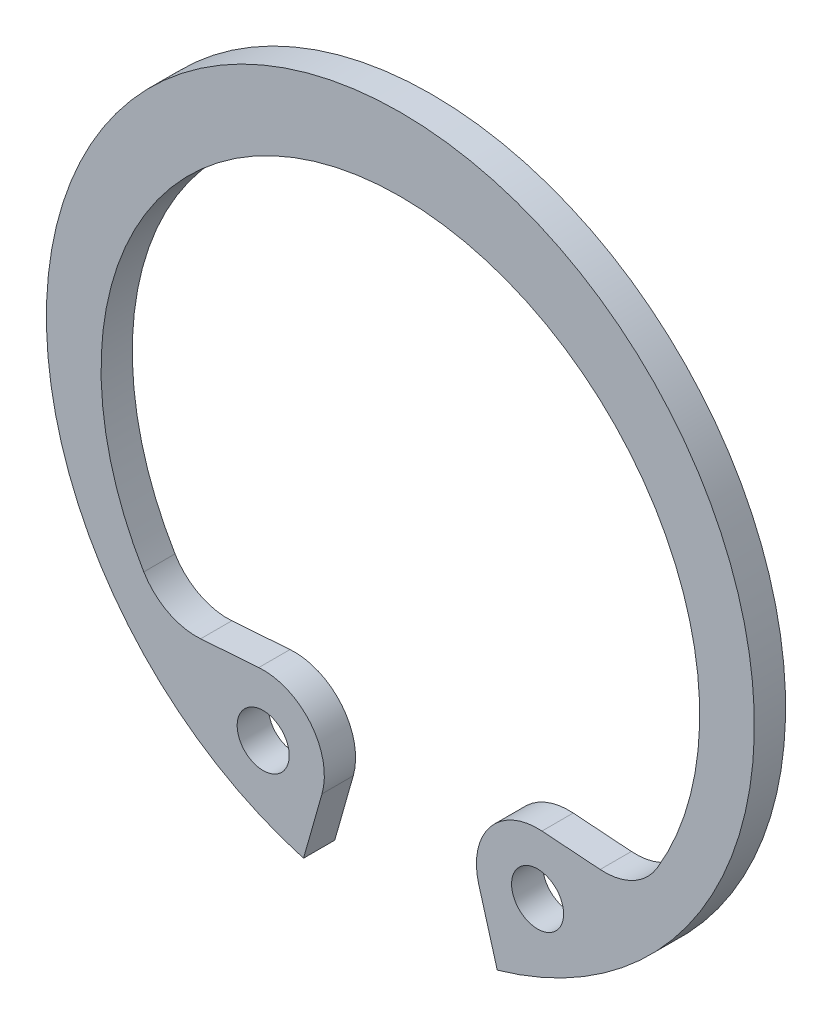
from build123d import *

# Parameters (mm, degrees)
ESQUISSE1_R          = 1
BASE_EXTRUSION_DEPTH = 1.2


with BuildPart() as part:
    # Esquisse1 → Base-Extrusion (new body)
    with BuildSketch(Plane.XY):
        with BuildLine():
            Line((3.010790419, -10.581830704), (3.721816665, -13.080828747))
            ThreePointArc((3.721816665, -13.080828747), (0, 13.6), (-3.721816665, -13.080828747))
            Line((-3.721816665, -13.080828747), (-3.010790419, -10.581830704))
            ThreePointArc((-3.010790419, -10.581830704), (-3.447828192, -8.456072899), (-5.439821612, -7.594788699))
            Line((-5.439821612, -7.594788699), (-7.674846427, -7.755689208))
            ThreePointArc((-7.674846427, -7.755689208), (-8.926668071, -7.497285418), (-9.858060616, -6.621878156))
            ThreePointArc((-9.858060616, -6.621878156), (0, 10.8), (9.858060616, -6.621878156))
            ThreePointArc((9.858060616, -6.621878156), (8.926668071, -7.497285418), (7.674846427, -7.755689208))
            Line((7.674846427, -7.755689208), (5.439821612, -7.594788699))
            ThreePointArc((5.439821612, -7.594788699), (3.447828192, -8.456072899), (3.010790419, -10.581830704))
        make_face()
        with Locations((5.27108068, -9.938722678)):
            Circle(ESQUISSE1_R, mode=Mode.SUBTRACT)
        with Locations(Location((-5.27108068, -9.938722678, 0), (0, 0, 180))):
            Circle(ESQUISSE1_R, mode=Mode.SUBTRACT)
    extrude(amount=BASE_EXTRUSION_DEPTH)


solid = part.part
